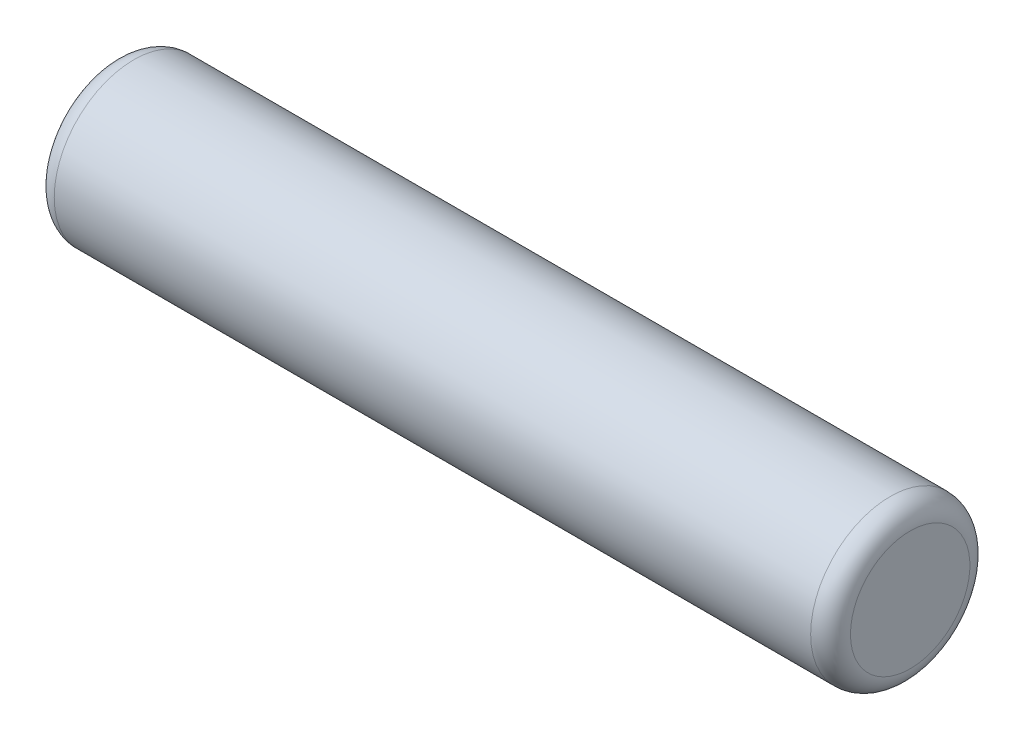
ISO-10303-21;
HEADER;
FILE_DESCRIPTION(('STEP AP214'),'2;1');
FILE_NAME('part.step','',(''),(''),'','','');
FILE_SCHEMA(('AUTOMOTIVE_DESIGN { 1 0 10303 214 1 1 1 1 }'));
ENDSEC;
DATA;
#1=APPLICATION_CONTEXT('core data for automotive mechanical design processes');
#2=APPLICATION_PROTOCOL_DEFINITION('international standard','automotive_design',2000,#1);
#3=PRODUCT_CONTEXT('',#1,'mechanical');
#4=PRODUCT('Part','Part','',(#3));
#5=PRODUCT_RELATED_PRODUCT_CATEGORY('part','',(#4));
#6=PRODUCT_DEFINITION_FORMATION('','',#4);
#7=PRODUCT_DEFINITION_CONTEXT('part definition',#1,'design');
#8=PRODUCT_DEFINITION('design','',#6,#7);
#9=PRODUCT_DEFINITION_SHAPE('','',#8);
#10=(LENGTH_UNIT() NAMED_UNIT(*) SI_UNIT(.MILLI.,.METRE.));
#11=(NAMED_UNIT(*) PLANE_ANGLE_UNIT() SI_UNIT($,.RADIAN.));
#12=(NAMED_UNIT(*) SI_UNIT($,.STERADIAN.) SOLID_ANGLE_UNIT());
#13=UNCERTAINTY_MEASURE_WITH_UNIT(LENGTH_MEASURE(1.E-05),#10,'distance_accuracy_value','');
#14=(GEOMETRIC_REPRESENTATION_CONTEXT(3) GLOBAL_UNCERTAINTY_ASSIGNED_CONTEXT((#13)) GLOBAL_UNIT_ASSIGNED_CONTEXT((#10,
#11,#12)) REPRESENTATION_CONTEXT('',''));
#15=CARTESIAN_POINT('',(0.,0.,0.));
#16=DIRECTION('',(0.,0.,1.));
#17=DIRECTION('',(1.,0.,0.));
#18=AXIS2_PLACEMENT_3D('',#15,#16,#17);
#19=CARTESIAN_POINT('',(0.,0.,0.));
#20=DIRECTION('',(1.,0.,0.));
#21=DIRECTION('',(0.,0.,-1.));
#22=AXIS2_PLACEMENT_3D('',#19,#20,#21);
#23=PLANE('',#22);
#24=CARTESIAN_POINT('',(0.,0.,0.));
#25=DIRECTION('',(1.,0.,0.));
#26=DIRECTION('',(0.,0.,-1.));
#27=AXIS2_PLACEMENT_3D('',#24,#25,#26);
#28=CIRCLE('',#27,6.);
#29=CARTESIAN_POINT('',(0.,0.,-6.));
#30=VERTEX_POINT('',#29);
#31=EDGE_CURVE('E29',#30,#30,#28,.F.);
#32=ORIENTED_EDGE('',*,*,#31,.T.);
#33=EDGE_LOOP('',(#32));
#34=FACE_BOUND('',#33,.T.);
#35=ADVANCED_FACE('F14',(#34),#23,.F.);
#36=CARTESIAN_POINT('',(0.,0.,0.));
#37=DIRECTION('',(-1.,0.,0.));
#38=DIRECTION('',(0.,0.,1.));
#39=AXIS2_PLACEMENT_3D('',#36,#37,#38);
#40=CYLINDRICAL_SURFACE('',#39,8.);
#41=CARTESIAN_POINT('',(2.,0.,0.));
#42=DIRECTION('',(1.,0.,0.));
#43=DIRECTION('',(0.,0.,-1.));
#44=AXIS2_PLACEMENT_3D('',#41,#42,#43);
#45=CIRCLE('',#44,8.);
#46=CARTESIAN_POINT('',(2.,0.,-8.));
#47=VERTEX_POINT('',#46);
#48=EDGE_CURVE('E21',#47,#47,#45,.T.);
#49=ORIENTED_EDGE('',*,*,#48,.T.);
#50=EDGE_LOOP('',(#49));
#51=FACE_BOUND('',#50,.T.);
#52=CARTESIAN_POINT('',(78.,0.,0.));
#53=DIRECTION('',(-1.,0.,0.));
#54=DIRECTION('',(0.,0.,1.));
#55=AXIS2_PLACEMENT_3D('',#52,#53,#54);
#56=CIRCLE('',#55,8.);
#57=CARTESIAN_POINT('',(78.,0.,8.));
#58=VERTEX_POINT('',#57);
#59=EDGE_CURVE('E25',#58,#58,#56,.T.);
#60=ORIENTED_EDGE('',*,*,#59,.T.);
#61=EDGE_LOOP('',(#60));
#62=FACE_BOUND('',#61,.T.);
#63=ADVANCED_FACE('F47',(#51,#62),#40,.T.);
#64=CARTESIAN_POINT('',(80.,8.,0.));
#65=DIRECTION('',(-1.,0.,0.));
#66=DIRECTION('',(0.,0.,1.));
#67=AXIS2_PLACEMENT_3D('',#64,#65,#66);
#68=PLANE('',#67);
#69=CARTESIAN_POINT('',(80.,0.,0.));
#70=DIRECTION('',(-1.,0.,0.));
#71=DIRECTION('',(0.,0.,1.));
#72=AXIS2_PLACEMENT_3D('',#69,#70,#71);
#73=CIRCLE('',#72,6.);
#74=CARTESIAN_POINT('',(80.,0.,6.));
#75=VERTEX_POINT('',#74);
#76=EDGE_CURVE('E9',#75,#75,#73,.F.);
#77=ORIENTED_EDGE('',*,*,#76,.T.);
#78=EDGE_LOOP('',(#77));
#79=FACE_BOUND('',#78,.T.);
#80=ADVANCED_FACE('F38',(#79),#68,.F.);
#81=CARTESIAN_POINT('',(2.,0.,0.));
#82=DIRECTION('',(1.,0.,0.));
#83=DIRECTION('',(0.,0.,-1.));
#84=AXIS2_PLACEMENT_3D('',#81,#82,#83);
#85=TOROIDAL_SURFACE('',#84,6.,2.);
#86=ORIENTED_EDGE('',*,*,#48,.F.);
#87=EDGE_LOOP('',(#86));
#88=FACE_BOUND('',#87,.T.);
#89=ORIENTED_EDGE('',*,*,#31,.F.);
#90=EDGE_LOOP('',(#89));
#91=FACE_BOUND('',#90,.T.);
#92=ADVANCED_FACE('F36',(#88,#91),#85,.T.);
#93=CARTESIAN_POINT('',(78.,0.,0.));
#94=DIRECTION('',(-1.,0.,0.));
#95=DIRECTION('',(0.,0.,1.));
#96=AXIS2_PLACEMENT_3D('',#93,#94,#95);
#97=TOROIDAL_SURFACE('',#96,6.,2.);
#98=ORIENTED_EDGE('',*,*,#76,.F.);
#99=EDGE_LOOP('',(#98));
#100=FACE_BOUND('',#99,.T.);
#101=ORIENTED_EDGE('',*,*,#59,.F.);
#102=EDGE_LOOP('',(#101));
#103=FACE_BOUND('',#102,.T.);
#104=ADVANCED_FACE('F16',(#100,#103),#97,.T.);
#105=CLOSED_SHELL('',(#35,#63,#80,#92,#104));
#106=MANIFOLD_SOLID_BREP('B1',#105);
#107=ADVANCED_BREP_SHAPE_REPRESENTATION('',(#18,#106),#14);
#108=SHAPE_DEFINITION_REPRESENTATION(#9,#107);
ENDSEC;
END-ISO-10303-21;
